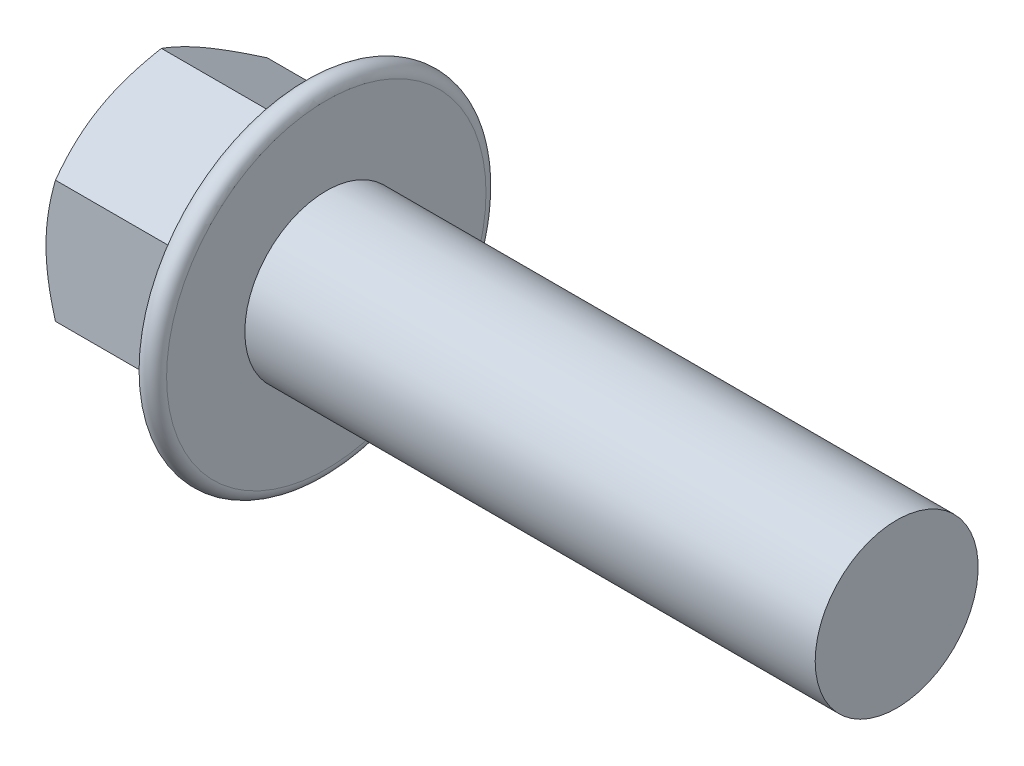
from build123d import *

# Parameters (mm, degrees)
HEX_DIE_START     = -1e-06
SKETCH2_R         = 7.580831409
HEX_DIE_DEPTH     = 10.700001
FLANGEHEXFILLET_R = 0.6
SKETCH4_R         = 5.6875
INDENT_DEPTH      = 0.891666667


with BuildPart() as part:
    # BodySke → Base-Revolve (revolve)
    with BuildSketch(Plane.XY, mode=Mode.PRIVATE) as base_revolve_sk:
        Polygon((10.7, 5), (10.7, 7.505773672), (0.5806837, 7.505773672), (0, 6.5), (0, 0), (45.7, 0), (45.7, 5), align=None)
    revolve(base_revolve_sk.sketch.rotate(Axis((-25.4, 0, 0), (1, 0, 0)), 90), axis=Axis((-25.4, 0, 0), (1, 0, 0)))

    # Sketch2 → Hex-Die (cut)
    with BuildSketch(Plane(origin=(0, 0, 0), x_dir=(0, 0, -1), z_dir=(1, 0, 0)).offset(HEX_DIE_START)):
        Circle(SKETCH2_R)
        Polygon((-6.5, 3.752776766), (0, 7.505553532), (6.5, 3.752776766), (6.5, -3.752776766), (0, -7.505553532), (-6.5, -3.752776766), align=None, mode=Mode.SUBTRACT)
    extrude(amount=HEX_DIE_DEPTH, mode=Mode.SUBTRACT)

    # Sketch5 → Flange (revolve)
    with BuildSketch(Plane.XY, mode=Mode.PRIVATE) as flange_sk:
        with BuildLine():
            Line((5.688167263, 0), (9.342215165, 10.0394141))
            ThreePointArc((9.342215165, 10.0394141), (10.121553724, 10.489365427), (10.7, 9.8))
            Line((10.7, 9.8), (10.7, 0))
            Line((10.7, 0), (5.688167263, 0))
        make_face()
    revolve(flange_sk.sketch.rotate(Axis((0, 0, 0), (1, 0, 0)), 90), axis=Axis((0, 0, 0), (1, 0, 0)))

    # FlangeHexFillet
    flangehexfillet_edges = [part.edges().sort_by_distance(p)[0] for p in [
        (8.151404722, 1.884573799, 6.5),
        (8.053973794, 5.629165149, 3.25),
        (8.053973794, 5.629165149, -3.25),
        (8.053973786, 0, -6.5),
        (8.053973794, -5.629165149, -3.25),
        (8.053973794, -5.629165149, 3.25),
        (8.151404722, -1.884573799, 6.5),
    ]]
    fillet(flangehexfillet_edges, radius=FLANGEHEXFILLET_R)

    # Sketch4 → Indent (cut)
    with BuildSketch(Plane(origin=(0, 0, 0), x_dir=(0, 0, -1), z_dir=(1, 0, 0))):
        Circle(SKETCH4_R)
    extrude(amount=INDENT_DEPTH, mode=Mode.SUBTRACT)


solid = part.part
